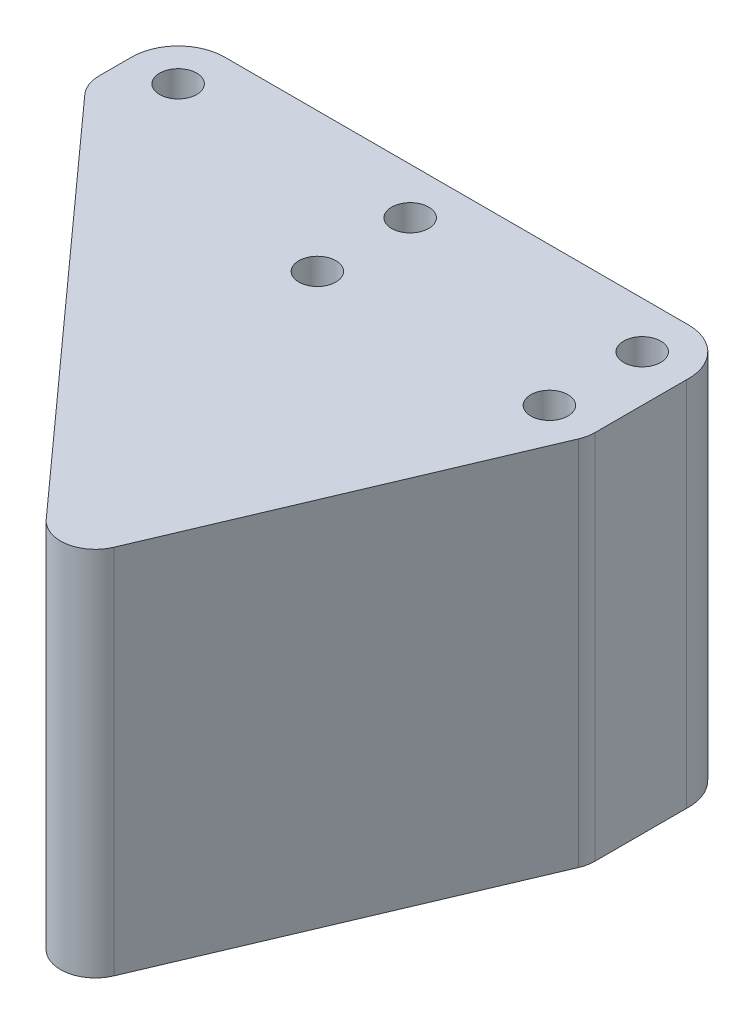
from build123d import *

# Parameters (mm, degrees)
SKETCH_1_R          = 4
SKETCH_1_R_2        = 1.6
EXTRUDE_1_DEPTH     = 4
SKETCH_2_R          = 1.6
CUT_EXTRUDE_1_DEPTH = 184.218448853
EXTRUDE_START       = 32
SKETCH_3_R          = 1.6
EXTRUDE_2_DEPTH     = 32
SKETCH_4_W          = 250
SKETCH_4_H          = 30
CUT_EXTRUDE_2_DEPTH = 4
FILLET_1_R          = 3


with BuildPart() as part:
    # Sketch 1 → Extrude 1 (new body)
    with BuildSketch(Plane(origin=(0, 0, 0), x_dir=(1, 0, 0), z_dir=(0, 1, 0))):
        with BuildLine():
            Line((0, -8), (-180, -8))
            ThreePointArc((-180, -8), (-182.961794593, -5.477255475), (-180.942355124, -2.151848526))
            Line((-180.942355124, -2.151848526), (-160, 4.777254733))
            ThreePointArc((-160, 4.777254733), (-150.128994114, 7.189150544), (-140, 8))
            Line((-140, 8), (0, 8))
            ThreePointArc((0, 8), (8, 0), (0, -8))
        make_face()
        with Locations(Location((0, 0, 0), (0, 0, 270))):
            Circle(SKETCH_1_R, mode=Mode.SUBTRACT)
        with Locations(Location((-70, 0, 0), (0, 0, 270))):
            Circle(SKETCH_1_R, mode=Mode.SUBTRACT)
        with Locations(Location((-180, -5, 0), (0, 0, 270))):
            Circle(SKETCH_1_R_2, mode=Mode.SUBTRACT)
        with Locations(Location((-170, -5, 0), (0, 0, 270))):
            Circle(SKETCH_1_R_2, mode=Mode.SUBTRACT)
        with Locations(Location((-160, -5, 0), (0, 0, 270))):
            Circle(SKETCH_1_R_2, mode=Mode.SUBTRACT)
    extrude(amount=EXTRUDE_1_DEPTH)

    # Sketch 2 → Cut-Extrude 1 (cut, through all)
    with BuildSketch(Plane(origin=(0, 4, 0), x_dir=(1, 0, 0), z_dir=(0, 1, 0))):
        with Locations(Location((-135, 5, 0), (0, 0, 270))):
            Circle(SKETCH_2_R)
        with Locations(Location((-115, 5, 0), (0, 0, 270))):
            Circle(SKETCH_2_R)
        with Locations(Location((-95, 5, 0), (0, 0, 270))):
            Circle(SKETCH_2_R)
        with Locations(Location((-135, -4, 0), (0, 0, 270))):
            Circle(SKETCH_2_R)
        with Locations(Location((-115, -4, 0), (0, 0, 270))):
            Circle(SKETCH_2_R)
        with Locations(Location((-95, -4, 0), (0, 0, 270))):
            Circle(SKETCH_2_R)
        with Locations(Location((-55, -4, 0), (0, 0, 270))):
            Circle(SKETCH_2_R)
        with Locations(Location((-35, -4, 0), (0, 0, 270))):
            Circle(SKETCH_2_R)
        with Locations(Location((-15, -4, 0), (0, 0, 270))):
            Circle(SKETCH_2_R)
        with Locations(Location((-55, 4, 0), (0, 0, 270))):
            Circle(SKETCH_2_R)
        with Locations(Location((-35, 4, 0), (0, 0, 270))):
            Circle(SKETCH_2_R)
        with Locations(Location((-15, 4, 0), (0, 0, 270))):
            Circle(SKETCH_2_R)
    extrude(amount=-CUT_EXTRUDE_1_DEPTH, mode=Mode.SUBTRACT)

    # Sketch 3 → Extrude 2 (add)
    with BuildSketch(Plane(origin=(0, 4, 0), x_dir=(1, 0, 0), z_dir=(0, 1, 0)).offset(EXTRUDE_START)):
        with BuildLine():
            Line((-55, 8), (-15, 8))
            ThreePointArc((-15, 8), (-12.112822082, 6.76842982), (-11.003525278, 3.832101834))
            Line((-11.003525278, 3.832101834), (-11.003525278, -4.680452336))
            Line((-11.003525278, -4.680452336), (-25.019840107, -37.700820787))
            Line((-25.019840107, -37.700820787), (-59, 0.037970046))
            Line((-59, 0.037970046), (-59, 4))
            ThreePointArc((-59, 4), (-57.828427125, 6.828427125), (-55, 8))
        make_face()
        with Locations(Location((-55, 4, 0), (0, 0, 270))):
            Circle(SKETCH_3_R, mode=Mode.SUBTRACT)
        with Locations(Location((-35, 4, 0), (0, 0, 270))):
            Circle(SKETCH_3_R, mode=Mode.SUBTRACT)
        with Locations(Location((-35, -4, 0), (0, 0, 270))):
            Circle(SKETCH_3_R, mode=Mode.SUBTRACT)
        with Locations(Location((-15, 4, 0), (0, 0, 270))):
            Circle(SKETCH_3_R, mode=Mode.SUBTRACT)
        with Locations(Location((-15, -4, 0), (0, 0, 270))):
            Circle(SKETCH_3_R, mode=Mode.SUBTRACT)
    extrude(amount=-EXTRUDE_2_DEPTH)

    # Sketch 4 → Cut-Extrude 2 (cut)
    with BuildSketch(Plane.XZ):
        with Locations((-70, 0)):
            Rectangle(SKETCH_4_W, SKETCH_4_H)
    extrude(amount=-CUT_EXTRUDE_2_DEPTH, mode=Mode.SUBTRACT)

    # Fillet 1
    fillet_1_edges = [part.edges().sort_by_distance(p)[0] for p in [
        (-59, 20, -0.037970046),
        (-25.019840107, 20, 37.700820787),
        (-11.003525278, 20, 4.680452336),
    ]]
    fillet(fillet_1_edges, radius=FILLET_1_R)


solid = part.part
